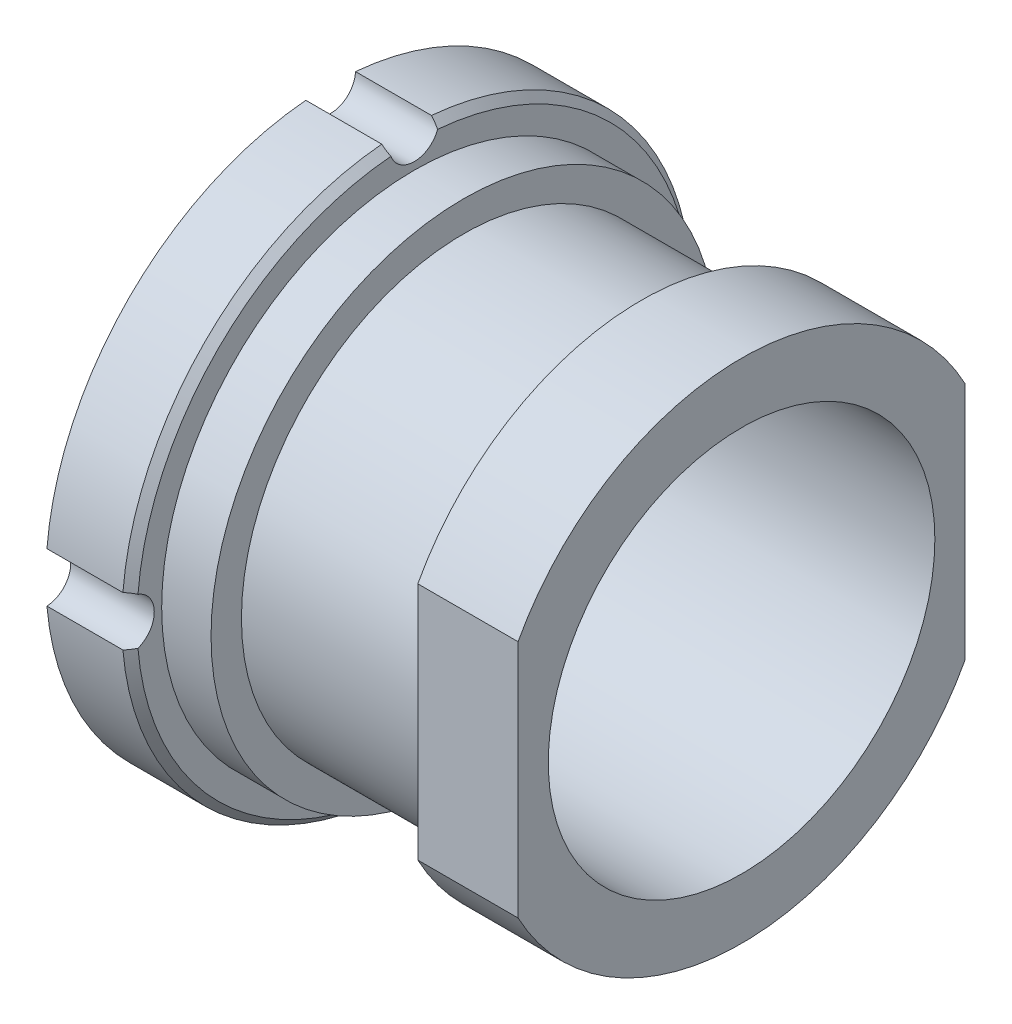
from build123d import *

# Parameters (mm, degrees)
SKETCH1_R           = 6.4643
BOSS_EXTRUDE1_DEPTH = 6.8707
SKETCH2_R           = 12.068907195
SKETCH2_R_2         = 7.4295
CUT_EXTRUDE1_DEPTH  = 13.7414
BOSS_EXTRUDE3_START = -4.445
SKETCH3_R           = 6.4643
BOSS_EXTRUDE3_DEPTH = 4.445
SKETCH4_R           = 13.191665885
SKETCH4_R_2         = 8.4455
CUT_EXTRUDE2_DEPTH  = 1.651
CHAMFER1_SIZE       = 0.254


with BuildPart() as part:
    # Sketch1 → Boss-Extrude1 (new, symmetric)
    with BuildSketch(Plane(origin=(0, 0, 0), x_dir=(0, 0, -1), z_dir=(1, 0, 0))):
        with BuildLine():
            Line((-7.47395, 4.000479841), (-7.47395, -4.000479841))
            ThreePointArc((-7.47395, -4.000479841), (0, -8.47725), (7.47395, -4.000479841))
            Line((7.47395, -4.000479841), (7.47395, 4.000479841))
            ThreePointArc((7.47395, 4.000479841), (0, 8.47725), (-7.47395, 4.000479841))
        make_face()
        Circle(SKETCH1_R, mode=Mode.SUBTRACT)
    extrude(amount=BOSS_EXTRUDE1_DEPTH, both=True)

    # Sketch2 → Cut-Extrude1 (cut)
    with BuildSketch(Plane(origin=(3.5179, 0, 0), x_dir=(0, 0, -1), z_dir=(1, 0, 0))):
        Circle(SKETCH2_R)
        Circle(SKETCH2_R_2, mode=Mode.SUBTRACT)
    extrude(amount=-CUT_EXTRUDE1_DEPTH, mode=Mode.SUBTRACT)

    # Sketch3 → Boss-Extrude3 (add)
    with BuildSketch(Plane(origin=(-2.4257, 0, 0), x_dir=(0, 0, -1), z_dir=(1, 0, 0)).offset(BOSS_EXTRUDE3_START)):
        with BuildLine():
            ThreePointArc((-0.831056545, 9.488675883), (-6.735192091, 6.735192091), (-9.488675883, 0.831056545))
            ThreePointArc((-9.488675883, 0.831056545), (-8.69315, 0), (-9.488675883, -0.831056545))
            ThreePointArc((-9.488675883, -0.831056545), (-6.735192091, -6.735192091), (-0.831056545, -9.488675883))
            ThreePointArc((-0.831056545, -9.488675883), (0, -8.69315), (0.831056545, -9.488675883))
            ThreePointArc((0.831056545, -9.488675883), (6.735192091, -6.735192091), (9.488675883, -0.831056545))
            ThreePointArc((9.488675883, -0.831056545), (8.69315, 0), (9.488675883, 0.831056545))
            ThreePointArc((9.488675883, 0.831056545), (6.735192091, 6.735192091), (0.831056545, 9.488675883))
            ThreePointArc((0.831056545, 9.488675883), (0, 8.69315), (-0.831056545, 9.488675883))
        make_face()
        Circle(SKETCH3_R, mode=Mode.SUBTRACT)
    extrude(amount=BOSS_EXTRUDE3_DEPTH)

    # Sketch4 → Cut-Extrude2 (cut)
    with BuildSketch(Plane(origin=(-2.4257, 0, 0), x_dir=(0, 0, -1), z_dir=(1, 0, 0))):
        Circle(SKETCH4_R)
        Circle(SKETCH4_R_2, mode=Mode.SUBTRACT)
    extrude(amount=-CUT_EXTRUDE2_DEPTH, mode=Mode.SUBTRACT)

    # Chamfer1
    chamfer1_edges = [part.edges().sort_by_distance(p)[0] for p in [
        (-4.0767, 6.735192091, -6.735192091),
        (-4.0767, 6.735192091, 6.735192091),
        (-4.0767, -6.735192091, -6.735192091),
        (-4.0767, -6.735192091, 6.735192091),
    ]]
    chamfer(chamfer1_edges, length=CHAMFER1_SIZE)


solid = part.part
